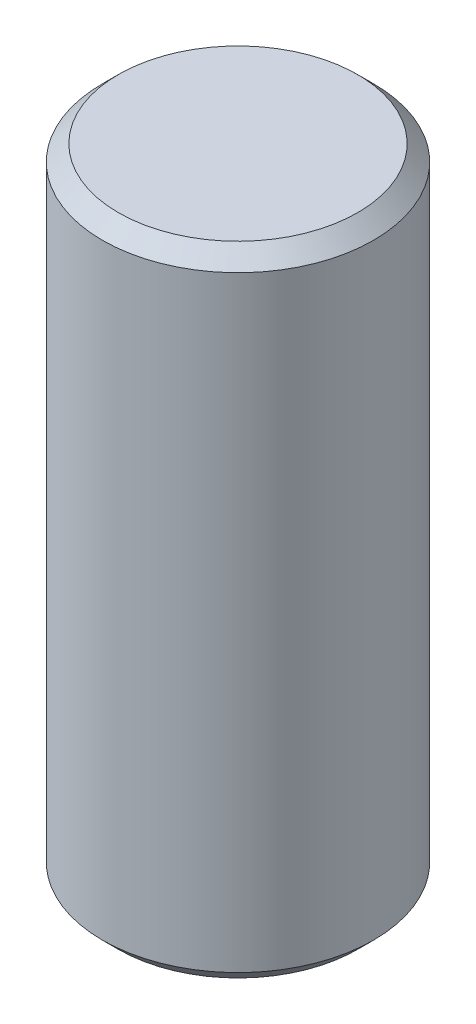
from build123d import *

# Parameters (mm, degrees)
SKETCH1_R           = 2.55
BOSS_EXTRUDE1_DEPTH = 6
CHAMFER1_SIZE       = 0.3


with BuildPart() as part:
    # Sketch1 → Boss-Extrude1 (new, symmetric)
    with BuildSketch(Plane(origin=(0, 0, 0), x_dir=(1, 0, 0), z_dir=(0, 1, 0))):
        with Locations(Location((0, 0, 0), (0, 0, 270))):
            Circle(SKETCH1_R)
    extrude(amount=BOSS_EXTRUDE1_DEPTH, both=True)

    # Chamfer1
    chamfer1_edges = [part.edges().sort_by_distance(p)[0] for p in [
        (0, -6, -2.55),
        (0, 6, -2.55),
    ]]
    chamfer(chamfer1_edges, length=CHAMFER1_SIZE)


solid = part.part
